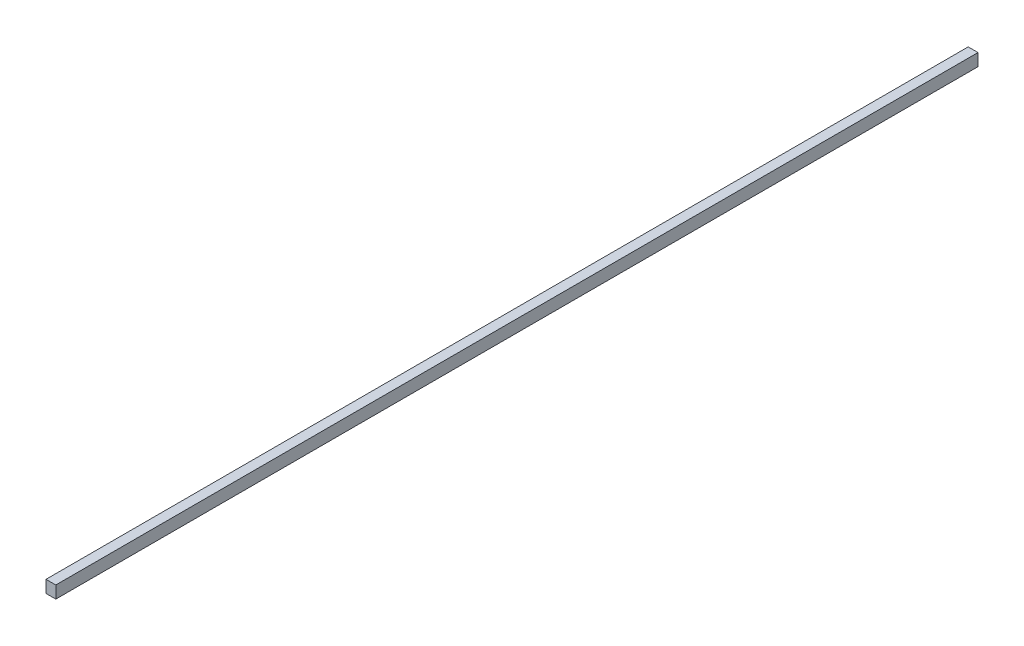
ISO-10303-21;
HEADER;
FILE_DESCRIPTION(('STEP AP214'),'2;1');
FILE_NAME('part.step','',(''),(''),'','','');
FILE_SCHEMA(('AUTOMOTIVE_DESIGN { 1 0 10303 214 1 1 1 1 }'));
ENDSEC;
DATA;
#1=APPLICATION_CONTEXT('core data for automotive mechanical design processes');
#2=APPLICATION_PROTOCOL_DEFINITION('international standard','automotive_design',2000,#1);
#3=PRODUCT_CONTEXT('',#1,'mechanical');
#4=PRODUCT('Part','Part','',(#3));
#5=PRODUCT_RELATED_PRODUCT_CATEGORY('part','',(#4));
#6=PRODUCT_DEFINITION_FORMATION('','',#4);
#7=PRODUCT_DEFINITION_CONTEXT('part definition',#1,'design');
#8=PRODUCT_DEFINITION('design','',#6,#7);
#9=PRODUCT_DEFINITION_SHAPE('','',#8);
#10=(LENGTH_UNIT() NAMED_UNIT(*) SI_UNIT(.MILLI.,.METRE.));
#11=(NAMED_UNIT(*) PLANE_ANGLE_UNIT() SI_UNIT($,.RADIAN.));
#12=(NAMED_UNIT(*) SI_UNIT($,.STERADIAN.) SOLID_ANGLE_UNIT());
#13=UNCERTAINTY_MEASURE_WITH_UNIT(LENGTH_MEASURE(1.E-05),#10,'distance_accuracy_value','');
#14=(GEOMETRIC_REPRESENTATION_CONTEXT(3) GLOBAL_UNCERTAINTY_ASSIGNED_CONTEXT((#13)) GLOBAL_UNIT_ASSIGNED_CONTEXT((#10,
#11,#12)) REPRESENTATION_CONTEXT('',''));
#15=CARTESIAN_POINT('',(0.,0.,0.));
#16=DIRECTION('',(0.,0.,1.));
#17=DIRECTION('',(1.,0.,0.));
#18=AXIS2_PLACEMENT_3D('',#15,#16,#17);
#19=CARTESIAN_POINT('',(0.,0.,1193.8));
#20=DIRECTION('',(1.,0.,0.));
#21=DIRECTION('',(0.,1.,0.));
#22=AXIS2_PLACEMENT_3D('',#19,#20,#21);
#23=PLANE('',#22);
#24=DIRECTION('',(0.,-1.,0.));
#25=VECTOR('',#24,1.);
#26=CARTESIAN_POINT('',(0.,0.,0.));
#27=LINE('',#26,#25);
#28=CARTESIAN_POINT('',(0.,0.,0.));
#29=VERTEX_POINT('',#28);
#30=CARTESIAN_POINT('',(0.,-15.875,0.));
#31=VERTEX_POINT('',#30);
#32=EDGE_CURVE('E94',#29,#31,#27,.T.);
#33=ORIENTED_EDGE('',*,*,#32,.T.);
#34=DIRECTION('',(0.,0.,-1.));
#35=VECTOR('',#34,1.);
#36=CARTESIAN_POINT('',(0.,-15.875,1193.8));
#37=LINE('',#36,#35);
#38=CARTESIAN_POINT('',(0.,-15.875,1193.8));
#39=VERTEX_POINT('',#38);
#40=EDGE_CURVE('E11',#39,#31,#37,.T.);
#41=ORIENTED_EDGE('',*,*,#40,.F.);
#42=DIRECTION('',(0.,-1.,0.));
#43=VECTOR('',#42,1.);
#44=CARTESIAN_POINT('',(0.,0.,1193.8));
#45=LINE('',#44,#43);
#46=CARTESIAN_POINT('',(0.,0.,1193.8));
#47=VERTEX_POINT('',#46);
#48=EDGE_CURVE('E82',#47,#39,#45,.T.);
#49=ORIENTED_EDGE('',*,*,#48,.F.);
#50=DIRECTION('',(0.,0.,-1.));
#51=VECTOR('',#50,1.);
#52=CARTESIAN_POINT('',(0.,0.,1193.8));
#53=LINE('',#52,#51);
#54=EDGE_CURVE('E90',#47,#29,#53,.T.);
#55=ORIENTED_EDGE('',*,*,#54,.T.);
#56=EDGE_LOOP('',(#33,#41,#49,#55));
#57=FACE_BOUND('',#56,.T.);
#58=ADVANCED_FACE('F31',(#57),#23,.F.);
#59=CARTESIAN_POINT('',(0.,-15.875,1193.8));
#60=DIRECTION('',(0.,1.,0.));
#61=DIRECTION('',(0.,0.,1.));
#62=AXIS2_PLACEMENT_3D('',#59,#60,#61);
#63=PLANE('',#62);
#64=DIRECTION('',(1.,0.,0.));
#65=VECTOR('',#64,1.);
#66=CARTESIAN_POINT('',(0.,-15.875,0.));
#67=LINE('',#66,#65);
#68=CARTESIAN_POINT('',(12.7,-15.875,0.));
#69=VERTEX_POINT('',#68);
#70=EDGE_CURVE('E86',#31,#69,#67,.T.);
#71=ORIENTED_EDGE('',*,*,#70,.T.);
#72=DIRECTION('',(0.,0.,-1.));
#73=VECTOR('',#72,1.);
#74=CARTESIAN_POINT('',(12.7,-15.875,1193.8));
#75=LINE('',#74,#73);
#76=CARTESIAN_POINT('',(12.7,-15.875,1193.8));
#77=VERTEX_POINT('',#76);
#78=EDGE_CURVE('E39',#77,#69,#75,.T.);
#79=ORIENTED_EDGE('',*,*,#78,.F.);
#80=DIRECTION('',(1.,0.,0.));
#81=VECTOR('',#80,1.);
#82=CARTESIAN_POINT('',(0.,-15.875,1193.8));
#83=LINE('',#82,#81);
#84=EDGE_CURVE('E77',#39,#77,#83,.T.);
#85=ORIENTED_EDGE('',*,*,#84,.F.);
#86=ORIENTED_EDGE('',*,*,#40,.T.);
#87=EDGE_LOOP('',(#71,#79,#85,#86));
#88=FACE_BOUND('',#87,.T.);
#89=ADVANCED_FACE('F85',(#88),#63,.F.);
#90=CARTESIAN_POINT('',(12.7,0.,1193.8));
#91=DIRECTION('',(-1.,0.,0.));
#92=DIRECTION('',(0.,-1.,0.));
#93=AXIS2_PLACEMENT_3D('',#90,#91,#92);
#94=PLANE('',#93);
#95=DIRECTION('',(0.,1.,0.));
#96=VECTOR('',#95,1.);
#97=CARTESIAN_POINT('',(12.7,0.,0.));
#98=LINE('',#97,#96);
#99=CARTESIAN_POINT('',(12.7,0.,0.));
#100=VERTEX_POINT('',#99);
#101=EDGE_CURVE('E64',#69,#100,#98,.T.);
#102=ORIENTED_EDGE('',*,*,#101,.T.);
#103=DIRECTION('',(0.,0.,-1.));
#104=VECTOR('',#103,1.);
#105=CARTESIAN_POINT('',(12.7,0.,1193.8));
#106=LINE('',#105,#104);
#107=CARTESIAN_POINT('',(12.7,0.,1193.8));
#108=VERTEX_POINT('',#107);
#109=EDGE_CURVE('E87',#108,#100,#106,.T.);
#110=ORIENTED_EDGE('',*,*,#109,.F.);
#111=DIRECTION('',(0.,1.,0.));
#112=VECTOR('',#111,1.);
#113=CARTESIAN_POINT('',(12.7,0.,1193.8));
#114=LINE('',#113,#112);
#115=EDGE_CURVE('E80',#77,#108,#114,.T.);
#116=ORIENTED_EDGE('',*,*,#115,.F.);
#117=ORIENTED_EDGE('',*,*,#78,.T.);
#118=EDGE_LOOP('',(#102,#110,#116,#117));
#119=FACE_BOUND('',#118,.T.);
#120=ADVANCED_FACE('F88',(#119),#94,.F.);
#121=CARTESIAN_POINT('',(0.,0.,1193.8));
#122=DIRECTION('',(0.,-1.,0.));
#123=DIRECTION('',(0.,0.,-1.));
#124=AXIS2_PLACEMENT_3D('',#121,#122,#123);
#125=PLANE('',#124);
#126=DIRECTION('',(-1.,0.,0.));
#127=VECTOR('',#126,1.);
#128=CARTESIAN_POINT('',(0.,0.,0.));
#129=LINE('',#128,#127);
#130=EDGE_CURVE('E70',#100,#29,#129,.T.);
#131=ORIENTED_EDGE('',*,*,#130,.T.);
#132=ORIENTED_EDGE('',*,*,#54,.F.);
#133=DIRECTION('',(-1.,0.,0.));
#134=VECTOR('',#133,1.);
#135=CARTESIAN_POINT('',(0.,0.,1193.8));
#136=LINE('',#135,#134);
#137=EDGE_CURVE('E47',#108,#47,#136,.T.);
#138=ORIENTED_EDGE('',*,*,#137,.F.);
#139=ORIENTED_EDGE('',*,*,#109,.T.);
#140=EDGE_LOOP('',(#131,#132,#138,#139));
#141=FACE_BOUND('',#140,.T.);
#142=ADVANCED_FACE('F101',(#141),#125,.F.);
#143=CARTESIAN_POINT('',(0.,-15.875,1193.8));
#144=DIRECTION('',(0.,0.,1.));
#145=DIRECTION('',(1.,0.,0.));
#146=AXIS2_PLACEMENT_3D('',#143,#144,#145);
#147=PLANE('',#146);
#148=ORIENTED_EDGE('',*,*,#48,.T.);
#149=ORIENTED_EDGE('',*,*,#84,.T.);
#150=ORIENTED_EDGE('',*,*,#115,.T.);
#151=ORIENTED_EDGE('',*,*,#137,.T.);
#152=EDGE_LOOP('',(#148,#149,#150,#151));
#153=FACE_BOUND('',#152,.T.);
#154=ADVANCED_FACE('F78',(#153),#147,.T.);
#155=CARTESIAN_POINT('',(0.,-15.875,0.));
#156=DIRECTION('',(0.,0.,1.));
#157=DIRECTION('',(1.,0.,0.));
#158=AXIS2_PLACEMENT_3D('',#155,#156,#157);
#159=PLANE('',#158);
#160=ORIENTED_EDGE('',*,*,#32,.F.);
#161=ORIENTED_EDGE('',*,*,#130,.F.);
#162=ORIENTED_EDGE('',*,*,#101,.F.);
#163=ORIENTED_EDGE('',*,*,#70,.F.);
#164=EDGE_LOOP('',(#160,#161,#162,#163));
#165=FACE_BOUND('',#164,.T.);
#166=ADVANCED_FACE('F104',(#165),#159,.F.);
#167=CLOSED_SHELL('',(#58,#89,#120,#142,#154,#166));
#168=MANIFOLD_SOLID_BREP('B2',#167);
#169=ADVANCED_BREP_SHAPE_REPRESENTATION('',(#18,#168),#14);
#170=SHAPE_DEFINITION_REPRESENTATION(#9,#169);
ENDSEC;
END-ISO-10303-21;
